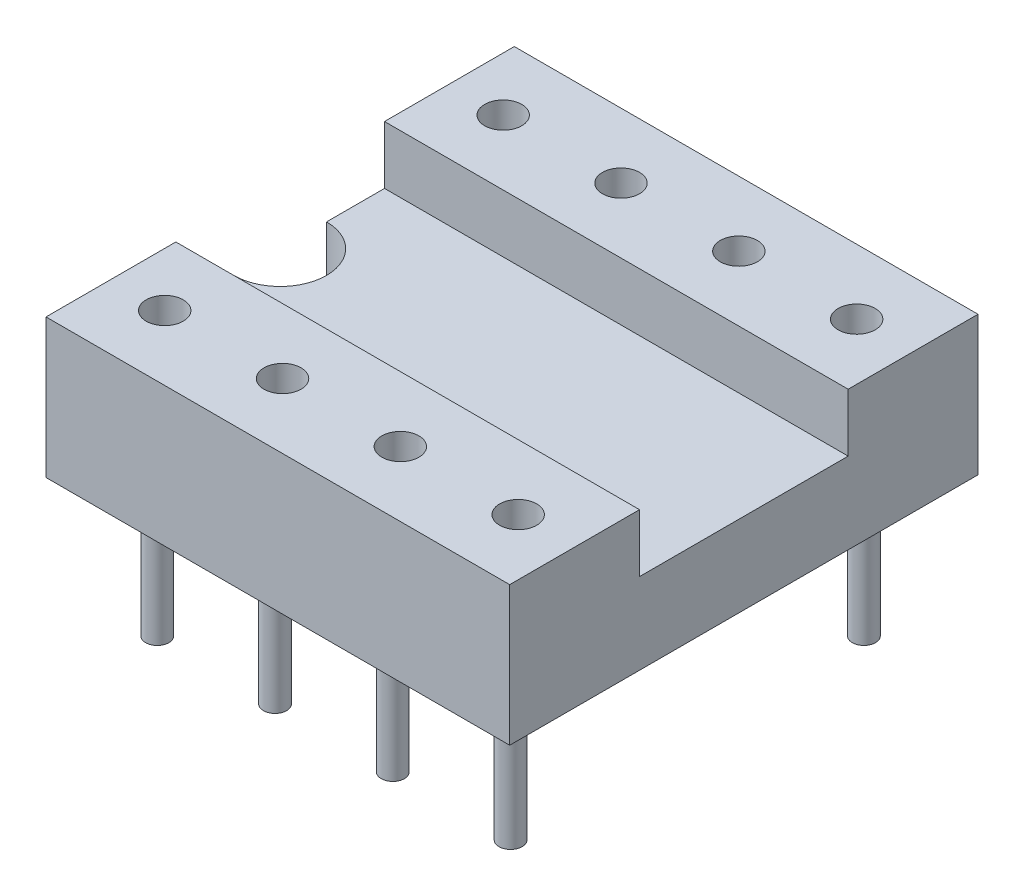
from build123d import *

# Parameters (mm, degrees)
EXTRUSION1_DEPTH        = 10
ENL_V_MAT_EXTRU_1_DEPTH = 12.338650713
ESQUISSE3_R             = 0.4
ENL_V_MAT_EXTRU_2_DEPTH = 2.5
ESQUISSE5_R             = 0.25
EXTRUSION2_DEPTH        = 3


with BuildPart() as part:
    # Esquisse1 → Extrusion1 (new body)
    with BuildSketch(Plane(origin=(0, 0, 0), x_dir=(0, 0, -1), z_dir=(1, 0, 0))):
        Polygon((-2.25, 1.75), (-2.25, 3), (-5.05, 3), (-5.05, 0), (5.05, 0), (5.05, 3), (2.25, 3), (2.25, 1.75), align=None)
    extrude(amount=EXTRUSION1_DEPTH)

    # Esquisse2 → Enl_v. mat.-Extru.1 (cut, through all)
    with BuildSketch(Plane(origin=(0, 1.75, 0), x_dir=(-1, 0, 0), z_dir=(0, 1, 0))):
        with BuildLine():
            Line((0, -1), (0, 1))
            ThreePointArc((0, 1), (-1, 0), (0, -1))
        make_face()
    extrude(amount=-ENL_V_MAT_EXTRU_1_DEPTH, mode=Mode.SUBTRACT)

    # Esquisse3 → Enl_v. mat.-Extru.2 (cut)
    with BuildSketch(Plane(origin=(0, 3, 0), x_dir=(-1, 0, 0), z_dir=(0, 1, 0))):
        with Locations(Location((-1.16, 3.65, 0), (0, 0, 90))):
            Circle(ESQUISSE3_R)
        with Locations(Location((-1.16, -3.65, 0), (0, 0, 270))):
            Circle(ESQUISSE3_R)
        with Locations(Location((-3.701, 3.65, 0), (0, 0, 90))):
            Circle(ESQUISSE3_R)
        with Locations(Location((-3.701, -3.65, 0), (0, 0, 270))):
            Circle(ESQUISSE3_R)
        with Locations(Location((-6.242, 3.65, 0), (0, 0, 90))):
            Circle(ESQUISSE3_R)
        with Locations(Location((-6.242, -3.65, 0), (0, 0, 270))):
            Circle(ESQUISSE3_R)
        with Locations(Location((-8.783, 3.65, 0), (0, 0, 90))):
            Circle(ESQUISSE3_R)
        with Locations(Location((-8.783, -3.65, 0), (0, 0, 270))):
            Circle(ESQUISSE3_R)
    extrude(amount=-ENL_V_MAT_EXTRU_2_DEPTH, mode=Mode.SUBTRACT)

    # Esquisse5 → Extrusion2 (add)
    with BuildSketch(Plane.XZ):
        with Locations(Location((1.16, 3.81, 0), (0, 0, 90))):
            Circle(ESQUISSE5_R)
        with Locations(Location((1.16, -3.81, 0), (0, 0, 90))):
            Circle(ESQUISSE5_R)
        with Locations(Location((3.7, -3.81, 0), (0, 0, 90))):
            Circle(ESQUISSE5_R)
        with Locations(Location((3.7, 3.81, 0), (0, 0, 90))):
            Circle(ESQUISSE5_R)
        with Locations(Location((6.24, -3.81, 0), (0, 0, 90))):
            Circle(ESQUISSE5_R)
        with Locations(Location((6.24, 3.81, 0), (0, 0, 90))):
            Circle(ESQUISSE5_R)
        with Locations(Location((8.78, -3.81, 0), (0, 0, 90))):
            Circle(ESQUISSE5_R)
        with Locations(Location((8.78, 3.81, 0), (0, 0, 90))):
            Circle(ESQUISSE5_R)
    extrude(amount=EXTRUSION2_DEPTH)


solid = part.part
